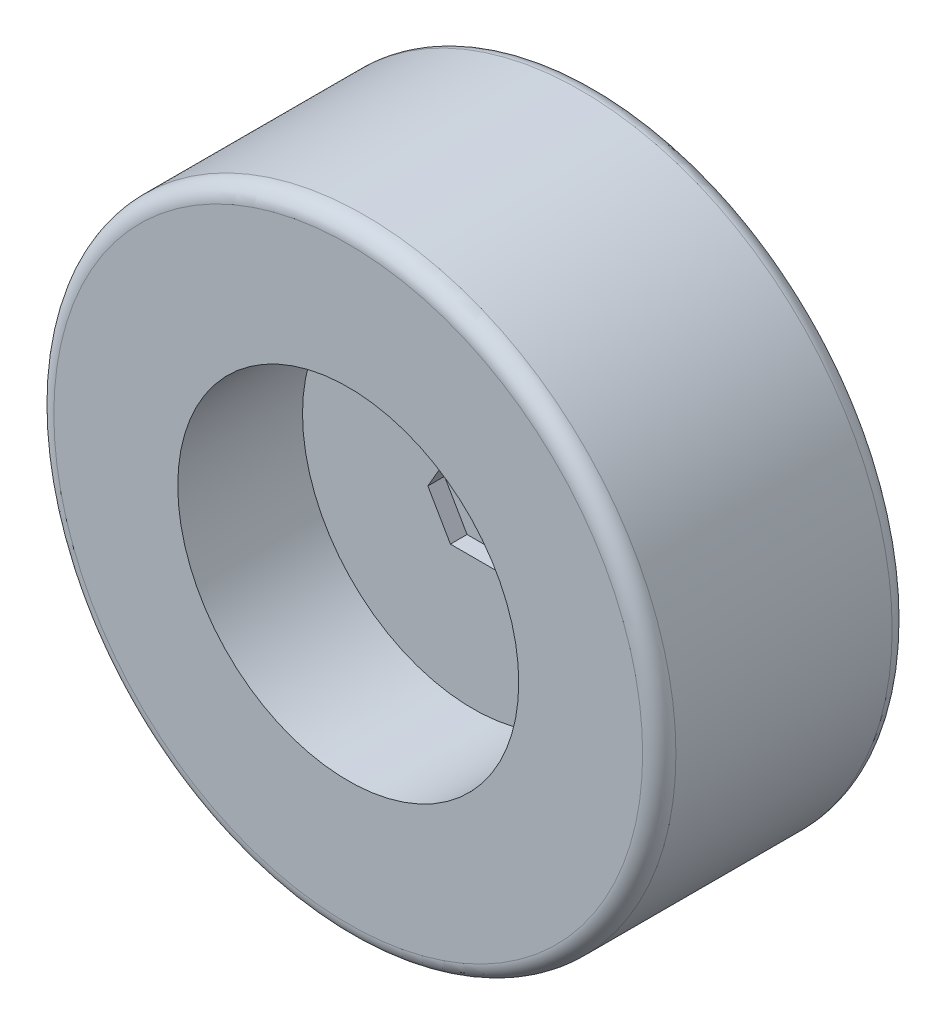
ISO-10303-21;
HEADER;
FILE_DESCRIPTION(('STEP AP214'),'2;1');
FILE_NAME('part.step','',(''),(''),'','','');
FILE_SCHEMA(('AUTOMOTIVE_DESIGN { 1 0 10303 214 1 1 1 1 }'));
ENDSEC;
DATA;
#1=APPLICATION_CONTEXT('core data for automotive mechanical design processes');
#2=APPLICATION_PROTOCOL_DEFINITION('international standard','automotive_design',2000,#1);
#3=PRODUCT_CONTEXT('',#1,'mechanical');
#4=PRODUCT('Part','Part','',(#3));
#5=PRODUCT_RELATED_PRODUCT_CATEGORY('part','',(#4));
#6=PRODUCT_DEFINITION_FORMATION('','',#4);
#7=PRODUCT_DEFINITION_CONTEXT('part definition',#1,'design');
#8=PRODUCT_DEFINITION('design','',#6,#7);
#9=PRODUCT_DEFINITION_SHAPE('','',#8);
#10=(LENGTH_UNIT() NAMED_UNIT(*) SI_UNIT(.MILLI.,.METRE.));
#11=(NAMED_UNIT(*) PLANE_ANGLE_UNIT() SI_UNIT($,.RADIAN.));
#12=(NAMED_UNIT(*) SI_UNIT($,.STERADIAN.) SOLID_ANGLE_UNIT());
#13=UNCERTAINTY_MEASURE_WITH_UNIT(LENGTH_MEASURE(1.E-05),#10,'distance_accuracy_value','');
#14=(GEOMETRIC_REPRESENTATION_CONTEXT(3) GLOBAL_UNCERTAINTY_ASSIGNED_CONTEXT((#13)) GLOBAL_UNIT_ASSIGNED_CONTEXT((#10,
#11,#12)) REPRESENTATION_CONTEXT('',''));
#15=CARTESIAN_POINT('',(0.,0.,0.));
#16=DIRECTION('',(0.,0.,1.));
#17=DIRECTION('',(1.,0.,0.));
#18=AXIS2_PLACEMENT_3D('',#15,#16,#17);
#19=CARTESIAN_POINT('',(0.,0.,38.1));
#20=DIRECTION('',(0.,0.,-1.));
#21=DIRECTION('',(-1.,0.,0.));
#22=AXIS2_PLACEMENT_3D('',#19,#20,#21);
#23=CYLINDRICAL_SURFACE('',#22,47.498);
#24=CARTESIAN_POINT('',(0.,0.,2.54));
#25=DIRECTION('',(0.,0.,1.));
#26=DIRECTION('',(1.,0.,0.));
#27=AXIS2_PLACEMENT_3D('',#24,#25,#26);
#28=CIRCLE('',#27,47.498);
#29=CARTESIAN_POINT('',(-47.498,0.,2.54));
#30=VERTEX_POINT('',#29);
#31=EDGE_CURVE('E157',#30,#30,#28,.T.);
#32=CARTESIAN_POINT('',(0.,0.,35.56));
#33=DIRECTION('',(0.,0.,1.));
#34=DIRECTION('',(1.,0.,0.));
#35=AXIS2_PLACEMENT_3D('',#32,#33,#34);
#36=CIRCLE('',#35,47.498);
#37=CARTESIAN_POINT('',(-47.498,0.,35.56));
#38=VERTEX_POINT('',#37);
#39=EDGE_CURVE('E149',#38,#38,#36,.F.);
#40=CARTESIAN_POINT('',(-47.498,0.,2.54));
#41=CARTESIAN_POINT('',(-47.498,0.,2.88395833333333));
#42=CARTESIAN_POINT('',(-47.498,0.,3.22791666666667));
#43=CARTESIAN_POINT('',(-47.498,0.,3.91583333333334));
#44=CARTESIAN_POINT('',(-47.498,0.,4.25979166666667));
#45=CARTESIAN_POINT('',(-47.498,0.,4.94770833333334));
#46=CARTESIAN_POINT('',(-47.498,0.,5.29166666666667));
#47=CARTESIAN_POINT('',(-47.498,0.,5.97958333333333));
#48=CARTESIAN_POINT('',(-47.498,0.,6.32354166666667));
#49=CARTESIAN_POINT('',(-47.498,0.,7.01145833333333));
#50=CARTESIAN_POINT('',(-47.498,0.,7.35541666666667));
#51=CARTESIAN_POINT('',(-47.498,0.,8.04333333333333));
#52=CARTESIAN_POINT('',(-47.498,0.,8.38729166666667));
#53=CARTESIAN_POINT('',(-47.498,0.,9.07520833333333));
#54=CARTESIAN_POINT('',(-47.498,0.,9.41916666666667));
#55=CARTESIAN_POINT('',(-47.498,0.,10.1070833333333));
#56=CARTESIAN_POINT('',(-47.498,0.,10.4510416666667));
#57=CARTESIAN_POINT('',(-47.498,0.,11.1389583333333));
#58=CARTESIAN_POINT('',(-47.498,0.,11.4829166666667));
#59=CARTESIAN_POINT('',(-47.498,0.,12.1708333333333));
#60=CARTESIAN_POINT('',(-47.498,0.,12.5147916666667));
#61=CARTESIAN_POINT('',(-47.498,0.,13.2027083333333));
#62=CARTESIAN_POINT('',(-47.498,0.,13.5466666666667));
#63=CARTESIAN_POINT('',(-47.498,0.,14.2345833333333));
#64=CARTESIAN_POINT('',(-47.498,0.,14.5785416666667));
#65=CARTESIAN_POINT('',(-47.498,0.,15.2664583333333));
#66=CARTESIAN_POINT('',(-47.498,0.,15.6104166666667));
#67=CARTESIAN_POINT('',(-47.498,0.,16.2983333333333));
#68=CARTESIAN_POINT('',(-47.498,0.,16.6422916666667));
#69=CARTESIAN_POINT('',(-47.498,0.,17.3302083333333));
#70=CARTESIAN_POINT('',(-47.498,0.,17.6741666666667));
#71=CARTESIAN_POINT('',(-47.498,0.,18.3620833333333));
#72=CARTESIAN_POINT('',(-47.498,0.,18.7060416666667));
#73=CARTESIAN_POINT('',(-47.498,0.,19.3939583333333));
#74=CARTESIAN_POINT('',(-47.498,0.,19.7379166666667));
#75=CARTESIAN_POINT('',(-47.498,0.,20.4258333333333));
#76=CARTESIAN_POINT('',(-47.498,0.,20.7697916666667));
#77=CARTESIAN_POINT('',(-47.498,0.,21.4577083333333));
#78=CARTESIAN_POINT('',(-47.498,0.,21.8016666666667));
#79=CARTESIAN_POINT('',(-47.498,0.,22.4895833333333));
#80=CARTESIAN_POINT('',(-47.498,0.,22.8335416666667));
#81=CARTESIAN_POINT('',(-47.498,0.,23.5214583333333));
#82=CARTESIAN_POINT('',(-47.498,0.,23.8654166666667));
#83=CARTESIAN_POINT('',(-47.498,0.,24.5533333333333));
#84=CARTESIAN_POINT('',(-47.498,0.,24.8972916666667));
#85=CARTESIAN_POINT('',(-47.498,0.,25.5852083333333));
#86=CARTESIAN_POINT('',(-47.498,0.,25.9291666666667));
#87=CARTESIAN_POINT('',(-47.498,0.,26.6170833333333));
#88=CARTESIAN_POINT('',(-47.498,0.,26.9610416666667));
#89=CARTESIAN_POINT('',(-47.498,0.,27.6489583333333));
#90=CARTESIAN_POINT('',(-47.498,0.,27.9929166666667));
#91=CARTESIAN_POINT('',(-47.498,0.,28.6808333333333));
#92=CARTESIAN_POINT('',(-47.498,0.,29.0247916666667));
#93=CARTESIAN_POINT('',(-47.498,0.,29.7127083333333));
#94=CARTESIAN_POINT('',(-47.498,0.,30.0566666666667));
#95=CARTESIAN_POINT('',(-47.498,0.,30.7445833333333));
#96=CARTESIAN_POINT('',(-47.498,0.,31.0885416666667));
#97=CARTESIAN_POINT('',(-47.498,0.,31.7764583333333));
#98=CARTESIAN_POINT('',(-47.498,0.,32.1204166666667));
#99=CARTESIAN_POINT('',(-47.498,0.,32.8083333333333));
#100=CARTESIAN_POINT('',(-47.498,0.,33.1522916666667));
#101=CARTESIAN_POINT('',(-47.498,0.,33.8402083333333));
#102=CARTESIAN_POINT('',(-47.498,0.,34.1841666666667));
#103=CARTESIAN_POINT('',(-47.498,0.,34.8720833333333));
#104=CARTESIAN_POINT('',(-47.498,0.,35.2160416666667));
#105=CARTESIAN_POINT('',(-47.498,0.,35.56));
#106=B_SPLINE_CURVE_WITH_KNOTS('',3,(#40,#41,#42,#43,#44,#45,#46,#47,#48,#49,#50,#51,#52,#53,
#54,#55,#56,#57,#58,#59,#60,#61,#62,#63,#64,#65,#66,#67,#68,#69,#70,#71,#72,#73,#74,#75,#76,#77,
#78,#79,#80,#81,#82,#83,#84,#85,#86,#87,#88,#89,#90,#91,#92,#93,#94,#95,#96,#97,#98,#99,#100,
#101,#102,#103,#104,#105),.UNSPECIFIED.,.F.,.F.,(4,2,2,2,2,2,2,2,2,2,2,2,2,2,2,2,2,2,2,2,2,2,2,
2,2,2,2,2,2,2,2,2,4),(0.,1.031875,2.06375,3.095625,4.1275,5.159375,6.19125,7.223125,8.255,
9.286875,10.31875,11.350625,12.3825,13.414375,14.44625,15.478125,16.51,17.541875,18.57375,
19.605625,20.6375,21.669375,22.70125,23.733125,24.765,25.796875,26.82875,27.860625,28.8925,
29.924375,30.95625,31.988125,33.02),.UNSPECIFIED.);
#107=EDGE_CURVE('BSEAM32',#30,#38,#106,.T.);
#108=ORIENTED_EDGE('',*,*,#31,.T.);
#109=ORIENTED_EDGE('',*,*,#39,.T.);
#110=ORIENTED_EDGE('',*,*,#107,.T.);
#111=ORIENTED_EDGE('',*,*,#107,.F.);
#112=EDGE_LOOP('',(#108,#110,#109,#111));
#113=FACE_BOUND('',#112,.T.);
#114=ADVANCED_FACE('F32',(#113),#23,.T.);
#115=CARTESIAN_POINT('',(0.,0.,38.1));
#116=DIRECTION('',(0.,0.,1.));
#117=DIRECTION('',(1.,0.,0.));
#118=AXIS2_PLACEMENT_3D('',#115,#116,#117);
#119=PLANE('',#118);
#120=CARTESIAN_POINT('',(0.,0.,38.1));
#121=DIRECTION('',(0.,0.,1.));
#122=DIRECTION('',(1.,0.,0.));
#123=AXIS2_PLACEMENT_3D('',#120,#121,#122);
#124=CIRCLE('',#123,44.958);
#125=CARTESIAN_POINT('',(44.958,0.,38.1));
#126=VERTEX_POINT('',#125);
#127=EDGE_CURVE('E11',#126,#126,#124,.T.);
#128=ORIENTED_EDGE('',*,*,#127,.T.);
#129=EDGE_LOOP('',(#128));
#130=FACE_BOUND('',#129,.T.);
#131=CARTESIAN_POINT('',(0.,0.,38.1));
#132=DIRECTION('',(0.,0.,1.));
#133=DIRECTION('',(1.,0.,0.));
#134=AXIS2_PLACEMENT_3D('',#131,#132,#133);
#135=CIRCLE('',#134,26.035);
#136=CARTESIAN_POINT('',(26.035,0.,38.1));
#137=VERTEX_POINT('',#136);
#138=EDGE_CURVE('E143',#137,#137,#135,.T.);
#139=ORIENTED_EDGE('',*,*,#138,.F.);
#140=EDGE_LOOP('',(#139));
#141=FACE_BOUND('',#140,.T.);
#142=ADVANCED_FACE('F173',(#130,#141),#119,.T.);
#143=CARTESIAN_POINT('',(0.,0.,0.));
#144=DIRECTION('',(0.,0.,1.));
#145=DIRECTION('',(1.,0.,0.));
#146=AXIS2_PLACEMENT_3D('',#143,#144,#145);
#147=PLANE('',#146);
#148=CARTESIAN_POINT('',(0.,0.,0.));
#149=DIRECTION('',(0.,0.,1.));
#150=DIRECTION('',(1.,0.,0.));
#151=AXIS2_PLACEMENT_3D('',#148,#149,#150);
#152=CIRCLE('',#151,44.958);
#153=CARTESIAN_POINT('',(44.958,0.,0.));
#154=VERTEX_POINT('',#153);
#155=EDGE_CURVE('E40',#154,#154,#152,.F.);
#156=ORIENTED_EDGE('',*,*,#155,.T.);
#157=EDGE_LOOP('',(#156));
#158=FACE_BOUND('',#157,.T.);
#159=CARTESIAN_POINT('',(0.,0.,0.));
#160=DIRECTION('',(0.,0.,-1.));
#161=DIRECTION('',(-1.,0.,0.));
#162=AXIS2_PLACEMENT_3D('',#159,#160,#161);
#163=CIRCLE('',#162,26.035);
#164=CARTESIAN_POINT('',(-26.035,0.,0.));
#165=VERTEX_POINT('',#164);
#166=EDGE_CURVE('E134',#165,#165,#163,.T.);
#167=ORIENTED_EDGE('',*,*,#166,.F.);
#168=EDGE_LOOP('',(#167));
#169=FACE_BOUND('',#168,.T.);
#170=ADVANCED_FACE('F162',(#158,#169),#147,.F.);
#171=CARTESIAN_POINT('',(0.,0.,19.05));
#172=DIRECTION('',(0.,0.,1.));
#173=DIRECTION('',(1.,0.,0.));
#174=AXIS2_PLACEMENT_3D('',#171,#172,#173);
#175=CYLINDRICAL_SURFACE('',#174,26.035);
#176=CARTESIAN_POINT('',(0.,0.,19.05));
#177=DIRECTION('',(0.,0.,1.));
#178=DIRECTION('',(1.,0.,0.));
#179=AXIS2_PLACEMENT_3D('',#176,#177,#178);
#180=CIRCLE('',#179,26.035);
#181=CARTESIAN_POINT('',(26.035,0.,19.05));
#182=VERTEX_POINT('',#181);
#183=EDGE_CURVE('E146',#182,#182,#180,.T.);
#184=CARTESIAN_POINT('',(26.035,0.,19.05));
#185=CARTESIAN_POINT('',(26.035,0.,19.2484375));
#186=CARTESIAN_POINT('',(26.035,0.,19.446875));
#187=CARTESIAN_POINT('',(26.035,0.,19.84375));
#188=CARTESIAN_POINT('',(26.035,0.,20.0421875));
#189=CARTESIAN_POINT('',(26.035,0.,20.4390625));
#190=CARTESIAN_POINT('',(26.035,0.,20.6375));
#191=CARTESIAN_POINT('',(26.035,0.,21.034375));
#192=CARTESIAN_POINT('',(26.035,0.,21.2328125));
#193=CARTESIAN_POINT('',(26.035,0.,21.6296875));
#194=CARTESIAN_POINT('',(26.035,0.,21.828125));
#195=CARTESIAN_POINT('',(26.035,0.,22.225));
#196=CARTESIAN_POINT('',(26.035,0.,22.4234375));
#197=CARTESIAN_POINT('',(26.035,0.,22.8203125));
#198=CARTESIAN_POINT('',(26.035,0.,23.01875));
#199=CARTESIAN_POINT('',(26.035,0.,23.415625));
#200=CARTESIAN_POINT('',(26.035,0.,23.6140625));
#201=CARTESIAN_POINT('',(26.035,0.,24.0109375));
#202=CARTESIAN_POINT('',(26.035,0.,24.209375));
#203=CARTESIAN_POINT('',(26.035,0.,24.60625));
#204=CARTESIAN_POINT('',(26.035,0.,24.8046875));
#205=CARTESIAN_POINT('',(26.035,0.,25.2015625));
#206=CARTESIAN_POINT('',(26.035,0.,25.4));
#207=CARTESIAN_POINT('',(26.035,0.,25.796875));
#208=CARTESIAN_POINT('',(26.035,0.,25.9953125));
#209=CARTESIAN_POINT('',(26.035,0.,26.3921875));
#210=CARTESIAN_POINT('',(26.035,0.,26.590625));
#211=CARTESIAN_POINT('',(26.035,0.,26.9875));
#212=CARTESIAN_POINT('',(26.035,0.,27.1859375));
#213=CARTESIAN_POINT('',(26.035,0.,27.5828125));
#214=CARTESIAN_POINT('',(26.035,0.,27.78125));
#215=CARTESIAN_POINT('',(26.035,0.,28.178125));
#216=CARTESIAN_POINT('',(26.035,0.,28.3765625));
#217=CARTESIAN_POINT('',(26.035,0.,28.7734375));
#218=CARTESIAN_POINT('',(26.035,0.,28.971875));
#219=CARTESIAN_POINT('',(26.035,0.,29.36875));
#220=CARTESIAN_POINT('',(26.035,0.,29.5671875));
#221=CARTESIAN_POINT('',(26.035,0.,29.9640625));
#222=CARTESIAN_POINT('',(26.035,0.,30.1625));
#223=CARTESIAN_POINT('',(26.035,0.,30.559375));
#224=CARTESIAN_POINT('',(26.035,0.,30.7578125));
#225=CARTESIAN_POINT('',(26.035,0.,31.1546875));
#226=CARTESIAN_POINT('',(26.035,0.,31.353125));
#227=CARTESIAN_POINT('',(26.035,0.,31.75));
#228=CARTESIAN_POINT('',(26.035,0.,31.9484375));
#229=CARTESIAN_POINT('',(26.035,0.,32.3453125));
#230=CARTESIAN_POINT('',(26.035,0.,32.54375));
#231=CARTESIAN_POINT('',(26.035,0.,32.940625));
#232=CARTESIAN_POINT('',(26.035,0.,33.1390625));
#233=CARTESIAN_POINT('',(26.035,0.,33.5359375));
#234=CARTESIAN_POINT('',(26.035,0.,33.734375));
#235=CARTESIAN_POINT('',(26.035,0.,34.13125));
#236=CARTESIAN_POINT('',(26.035,0.,34.3296875));
#237=CARTESIAN_POINT('',(26.035,0.,34.7265625));
#238=CARTESIAN_POINT('',(26.035,0.,34.925));
#239=CARTESIAN_POINT('',(26.035,0.,35.321875));
#240=CARTESIAN_POINT('',(26.035,0.,35.5203125));
#241=CARTESIAN_POINT('',(26.035,0.,35.9171875));
#242=CARTESIAN_POINT('',(26.035,0.,36.115625));
#243=CARTESIAN_POINT('',(26.035,0.,36.5125));
#244=CARTESIAN_POINT('',(26.035,0.,36.7109375));
#245=CARTESIAN_POINT('',(26.035,0.,37.1078125));
#246=CARTESIAN_POINT('',(26.035,0.,37.30625));
#247=CARTESIAN_POINT('',(26.035,0.,37.703125));
#248=CARTESIAN_POINT('',(26.035,0.,37.9015625));
#249=CARTESIAN_POINT('',(26.035,0.,38.1));
#250=B_SPLINE_CURVE_WITH_KNOTS('',3,(#184,#185,#186,#187,#188,#189,#190,#191,#192,#193,#194,
#195,#196,#197,#198,#199,#200,#201,#202,#203,#204,#205,#206,#207,#208,#209,#210,#211,#212,#213,
#214,#215,#216,#217,#218,#219,#220,#221,#222,#223,#224,#225,#226,#227,#228,#229,#230,#231,#232,
#233,#234,#235,#236,#237,#238,#239,#240,#241,#242,#243,#244,#245,#246,#247,#248,#249),
.UNSPECIFIED.,.F.,.F.,(4,2,2,2,2,2,2,2,2,2,2,2,2,2,2,2,2,2,2,2,2,2,2,2,2,2,2,2,2,2,2,2,4),(0.,
0.595312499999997,1.190625,1.7859375,2.38125,2.9765625,3.571875,4.1671875,4.7625,5.3578125,
5.953125,6.5484375,7.14375,7.7390625,8.334375,8.9296875,9.525,10.1203125,10.715625,11.3109375,
11.90625,12.5015625,13.096875,13.6921875,14.2875,14.8828125,15.478125,16.0734375,16.66875,
17.2640625,17.859375,18.4546875,19.05),.UNSPECIFIED.);
#251=EDGE_CURVE('BSEAM186',#182,#137,#250,.T.);
#252=ORIENTED_EDGE('',*,*,#183,.F.);
#253=ORIENTED_EDGE('',*,*,#138,.T.);
#254=ORIENTED_EDGE('',*,*,#251,.T.);
#255=ORIENTED_EDGE('',*,*,#251,.F.);
#256=EDGE_LOOP('',(#252,#254,#253,#255));
#257=FACE_BOUND('',#256,.T.);
#258=ADVANCED_FACE('F186',(#257),#175,.F.);
#259=CARTESIAN_POINT('',(0.,0.,19.05));
#260=DIRECTION('',(0.,0.,1.));
#261=DIRECTION('',(1.,0.,0.));
#262=AXIS2_PLACEMENT_3D('',#259,#260,#261);
#263=PLANE('',#262);
#264=DIRECTION('',(0.5,0.866025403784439,0.));
#265=VECTOR('',#264,1.);
#266=CARTESIAN_POINT('',(3.44620375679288,-5.969,19.05));
#267=LINE('',#266,#265);
#268=CARTESIAN_POINT('',(3.44620375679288,-5.969,19.05));
#269=VERTEX_POINT('',#268);
#270=CARTESIAN_POINT('',(6.89240751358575,0.,19.05));
#271=VERTEX_POINT('',#270);
#272=EDGE_CURVE('E119',#269,#271,#267,.T.);
#273=ORIENTED_EDGE('',*,*,#272,.F.);
#274=DIRECTION('',(1.,0.,0.));
#275=VECTOR('',#274,1.);
#276=CARTESIAN_POINT('',(-3.44620375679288,-5.969,19.05));
#277=LINE('',#276,#275);
#278=CARTESIAN_POINT('',(-3.44620375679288,-5.969,19.05));
#279=VERTEX_POINT('',#278);
#280=EDGE_CURVE('E130',#279,#269,#277,.T.);
#281=ORIENTED_EDGE('',*,*,#280,.F.);
#282=DIRECTION('',(0.5,-0.866025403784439,0.));
#283=VECTOR('',#282,1.);
#284=CARTESIAN_POINT('',(-6.89240751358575,0.,19.05));
#285=LINE('',#284,#283);
#286=CARTESIAN_POINT('',(-6.89240751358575,0.,19.05));
#287=VERTEX_POINT('',#286);
#288=EDGE_CURVE('E47',#287,#279,#285,.T.);
#289=ORIENTED_EDGE('',*,*,#288,.F.);
#290=DIRECTION('',(-0.5,-0.866025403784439,0.));
#291=VECTOR('',#290,1.);
#292=CARTESIAN_POINT('',(-3.44620375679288,5.969,19.05));
#293=LINE('',#292,#291);
#294=CARTESIAN_POINT('',(-3.44620375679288,5.969,19.05));
#295=VERTEX_POINT('',#294);
#296=EDGE_CURVE('E97',#295,#287,#293,.T.);
#297=ORIENTED_EDGE('',*,*,#296,.F.);
#298=DIRECTION('',(-1.,0.,0.));
#299=VECTOR('',#298,1.);
#300=CARTESIAN_POINT('',(3.44620375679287,5.969,19.05));
#301=LINE('',#300,#299);
#302=CARTESIAN_POINT('',(3.44620375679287,5.969,19.05));
#303=VERTEX_POINT('',#302);
#304=EDGE_CURVE('E125',#303,#295,#301,.T.);
#305=ORIENTED_EDGE('',*,*,#304,.F.);
#306=DIRECTION('',(-0.5,0.866025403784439,0.));
#307=VECTOR('',#306,1.);
#308=CARTESIAN_POINT('',(6.89240751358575,0.,19.05));
#309=LINE('',#308,#307);
#310=EDGE_CURVE('E121',#271,#303,#309,.T.);
#311=ORIENTED_EDGE('',*,*,#310,.F.);
#312=EDGE_LOOP('',(#273,#281,#289,#297,#305,#311));
#313=FACE_BOUND('',#312,.T.);
#314=ORIENTED_EDGE('',*,*,#183,.T.);
#315=EDGE_LOOP('',(#314));
#316=FACE_BOUND('',#315,.T.);
#317=ADVANCED_FACE('F188',(#313,#316),#263,.T.);
#318=CARTESIAN_POINT('',(0.,0.,6.35));
#319=DIRECTION('',(0.,0.,-1.));
#320=DIRECTION('',(-1.,0.,0.));
#321=AXIS2_PLACEMENT_3D('',#318,#319,#320);
#322=CYLINDRICAL_SURFACE('',#321,26.035);
#323=CARTESIAN_POINT('',(0.,0.,6.35));
#324=DIRECTION('',(0.,0.,-1.));
#325=DIRECTION('',(-1.,0.,0.));
#326=AXIS2_PLACEMENT_3D('',#323,#324,#325);
#327=CIRCLE('',#326,26.035);
#328=CARTESIAN_POINT('',(-26.035,0.,6.35));
#329=VERTEX_POINT('',#328);
#330=EDGE_CURVE('E140',#329,#329,#327,.T.);
#331=ORIENTED_EDGE('',*,*,#330,.F.);
#332=EDGE_LOOP('',(#331));
#333=FACE_BOUND('',#332,.T.);
#334=ORIENTED_EDGE('',*,*,#166,.T.);
#335=EDGE_LOOP('',(#334));
#336=FACE_BOUND('',#335,.T.);
#337=ADVANCED_FACE('F195',(#333,#336),#322,.F.);
#338=CARTESIAN_POINT('',(0.,0.,6.35));
#339=DIRECTION('',(0.,0.,-1.));
#340=DIRECTION('',(-1.,0.,0.));
#341=AXIS2_PLACEMENT_3D('',#338,#339,#340);
#342=PLANE('',#341);
#343=CARTESIAN_POINT('',(0.,0.,6.35));
#344=DIRECTION('',(0.,0.,-1.));
#345=DIRECTION('',(-1.,0.,0.));
#346=AXIS2_PLACEMENT_3D('',#343,#344,#345);
#347=CIRCLE('',#346,1.5875);
#348=CARTESIAN_POINT('',(-1.5875,0.,6.35));
#349=VERTEX_POINT('',#348);
#350=EDGE_CURVE('E154',#349,#349,#347,.T.);
#351=ORIENTED_EDGE('',*,*,#350,.F.);
#352=EDGE_LOOP('',(#351));
#353=FACE_BOUND('',#352,.T.);
#354=ORIENTED_EDGE('',*,*,#330,.T.);
#355=EDGE_LOOP('',(#354));
#356=FACE_BOUND('',#355,.T.);
#357=ADVANCED_FACE('F203',(#353,#356),#342,.T.);
#358=CARTESIAN_POINT('',(3.44620375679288,-5.969,16.51));
#359=DIRECTION('',(0.866025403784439,-0.5,0.));
#360=DIRECTION('',(0.5,0.866025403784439,0.));
#361=AXIS2_PLACEMENT_3D('',#358,#359,#360);
#362=PLANE('',#361);
#363=ORIENTED_EDGE('',*,*,#272,.T.);
#364=DIRECTION('',(0.,0.,1.));
#365=VECTOR('',#364,1.);
#366=CARTESIAN_POINT('',(6.89240751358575,0.,16.51));
#367=LINE('',#366,#365);
#368=CARTESIAN_POINT('',(6.89240751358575,0.,16.51));
#369=VERTEX_POINT('',#368);
#370=EDGE_CURVE('E79',#369,#271,#367,.T.);
#371=ORIENTED_EDGE('',*,*,#370,.F.);
#372=DIRECTION('',(0.5,0.866025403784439,0.));
#373=VECTOR('',#372,1.);
#374=CARTESIAN_POINT('',(3.44620375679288,-5.969,16.51));
#375=LINE('',#374,#373);
#376=CARTESIAN_POINT('',(3.44620375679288,-5.969,16.51));
#377=VERTEX_POINT('',#376);
#378=EDGE_CURVE('E132',#377,#369,#375,.T.);
#379=ORIENTED_EDGE('',*,*,#378,.F.);
#380=DIRECTION('',(0.,0.,1.));
#381=VECTOR('',#380,1.);
#382=CARTESIAN_POINT('',(3.44620375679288,-5.969,16.51));
#383=LINE('',#382,#381);
#384=EDGE_CURVE('E56',#377,#269,#383,.T.);
#385=ORIENTED_EDGE('',*,*,#384,.T.);
#386=EDGE_LOOP('',(#363,#371,#379,#385));
#387=FACE_BOUND('',#386,.T.);
#388=ADVANCED_FACE('F207',(#387),#362,.F.);
#389=CARTESIAN_POINT('',(-3.44620375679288,-5.969,16.51));
#390=DIRECTION('',(0.,-1.,0.));
#391=DIRECTION('',(1.,0.,0.));
#392=AXIS2_PLACEMENT_3D('',#389,#390,#391);
#393=PLANE('',#392);
#394=ORIENTED_EDGE('',*,*,#280,.T.);
#395=ORIENTED_EDGE('',*,*,#384,.F.);
#396=DIRECTION('',(1.,0.,0.));
#397=VECTOR('',#396,1.);
#398=CARTESIAN_POINT('',(-3.44620375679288,-5.969,16.51));
#399=LINE('',#398,#397);
#400=CARTESIAN_POINT('',(-3.44620375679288,-5.969,16.51));
#401=VERTEX_POINT('',#400);
#402=EDGE_CURVE('E106',#401,#377,#399,.T.);
#403=ORIENTED_EDGE('',*,*,#402,.F.);
#404=DIRECTION('',(0.,0.,1.));
#405=VECTOR('',#404,1.);
#406=CARTESIAN_POINT('',(-3.44620375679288,-5.969,16.51));
#407=LINE('',#406,#405);
#408=EDGE_CURVE('E98',#401,#279,#407,.T.);
#409=ORIENTED_EDGE('',*,*,#408,.T.);
#410=EDGE_LOOP('',(#394,#395,#403,#409));
#411=FACE_BOUND('',#410,.T.);
#412=ADVANCED_FACE('F211',(#411),#393,.F.);
#413=CARTESIAN_POINT('',(-6.89240751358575,0.,16.51));
#414=DIRECTION('',(-0.866025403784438,-0.5,0.));
#415=DIRECTION('',(0.5,-0.866025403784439,0.));
#416=AXIS2_PLACEMENT_3D('',#413,#414,#415);
#417=PLANE('',#416);
#418=ORIENTED_EDGE('',*,*,#288,.T.);
#419=ORIENTED_EDGE('',*,*,#408,.F.);
#420=DIRECTION('',(0.5,-0.866025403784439,0.));
#421=VECTOR('',#420,1.);
#422=CARTESIAN_POINT('',(-6.89240751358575,0.,16.51));
#423=LINE('',#422,#421);
#424=CARTESIAN_POINT('',(-6.89240751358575,0.,16.51));
#425=VERTEX_POINT('',#424);
#426=EDGE_CURVE('E102',#425,#401,#423,.T.);
#427=ORIENTED_EDGE('',*,*,#426,.F.);
#428=DIRECTION('',(0.,0.,1.));
#429=VECTOR('',#428,1.);
#430=CARTESIAN_POINT('',(-6.89240751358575,0.,16.51));
#431=LINE('',#430,#429);
#432=EDGE_CURVE('E90',#425,#287,#431,.T.);
#433=ORIENTED_EDGE('',*,*,#432,.T.);
#434=EDGE_LOOP('',(#418,#419,#427,#433));
#435=FACE_BOUND('',#434,.T.);
#436=ADVANCED_FACE('F103',(#435),#417,.F.);
#437=CARTESIAN_POINT('',(-3.44620375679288,5.969,16.51));
#438=DIRECTION('',(-0.866025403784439,0.5,0.));
#439=DIRECTION('',(-0.5,-0.866025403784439,0.));
#440=AXIS2_PLACEMENT_3D('',#437,#438,#439);
#441=PLANE('',#440);
#442=ORIENTED_EDGE('',*,*,#296,.T.);
#443=ORIENTED_EDGE('',*,*,#432,.F.);
#444=DIRECTION('',(-0.5,-0.866025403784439,0.));
#445=VECTOR('',#444,1.);
#446=CARTESIAN_POINT('',(-3.44620375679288,5.969,16.51));
#447=LINE('',#446,#445);
#448=CARTESIAN_POINT('',(-3.44620375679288,5.969,16.51));
#449=VERTEX_POINT('',#448);
#450=EDGE_CURVE('E94',#449,#425,#447,.T.);
#451=ORIENTED_EDGE('',*,*,#450,.F.);
#452=DIRECTION('',(0.,0.,1.));
#453=VECTOR('',#452,1.);
#454=CARTESIAN_POINT('',(-3.44620375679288,5.969,16.51));
#455=LINE('',#454,#453);
#456=EDGE_CURVE('E99',#449,#295,#455,.T.);
#457=ORIENTED_EDGE('',*,*,#456,.T.);
#458=EDGE_LOOP('',(#442,#443,#451,#457));
#459=FACE_BOUND('',#458,.T.);
#460=ADVANCED_FACE('F92',(#459),#441,.F.);
#461=CARTESIAN_POINT('',(3.44620375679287,5.969,16.51));
#462=DIRECTION('',(0.,1.,0.));
#463=DIRECTION('',(0.,0.,1.));
#464=AXIS2_PLACEMENT_3D('',#461,#462,#463);
#465=PLANE('',#464);
#466=ORIENTED_EDGE('',*,*,#304,.T.);
#467=ORIENTED_EDGE('',*,*,#456,.F.);
#468=DIRECTION('',(-1.,0.,0.));
#469=VECTOR('',#468,1.);
#470=CARTESIAN_POINT('',(3.44620375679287,5.969,16.51));
#471=LINE('',#470,#469);
#472=CARTESIAN_POINT('',(3.44620375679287,5.969,16.51));
#473=VERTEX_POINT('',#472);
#474=EDGE_CURVE('E112',#473,#449,#471,.T.);
#475=ORIENTED_EDGE('',*,*,#474,.F.);
#476=DIRECTION('',(0.,0.,1.));
#477=VECTOR('',#476,1.);
#478=CARTESIAN_POINT('',(3.44620375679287,5.969,16.51));
#479=LINE('',#478,#477);
#480=EDGE_CURVE('E137',#473,#303,#479,.T.);
#481=ORIENTED_EDGE('',*,*,#480,.T.);
#482=EDGE_LOOP('',(#466,#467,#475,#481));
#483=FACE_BOUND('',#482,.T.);
#484=ADVANCED_FACE('F215',(#483),#465,.F.);
#485=CARTESIAN_POINT('',(6.89240751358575,0.,16.51));
#486=DIRECTION('',(0.866025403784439,0.5,0.));
#487=DIRECTION('',(-0.5,0.866025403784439,0.));
#488=AXIS2_PLACEMENT_3D('',#485,#486,#487);
#489=PLANE('',#488);
#490=ORIENTED_EDGE('',*,*,#310,.T.);
#491=ORIENTED_EDGE('',*,*,#480,.F.);
#492=DIRECTION('',(-0.5,0.866025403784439,0.));
#493=VECTOR('',#492,1.);
#494=CARTESIAN_POINT('',(6.89240751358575,0.,16.51));
#495=LINE('',#494,#493);
#496=EDGE_CURVE('E114',#369,#473,#495,.T.);
#497=ORIENTED_EDGE('',*,*,#496,.F.);
#498=ORIENTED_EDGE('',*,*,#370,.T.);
#499=EDGE_LOOP('',(#490,#491,#497,#498));
#500=FACE_BOUND('',#499,.T.);
#501=ADVANCED_FACE('F212',(#500),#489,.F.);
#502=CARTESIAN_POINT('',(0.,0.,16.51));
#503=DIRECTION('',(0.,0.,1.));
#504=DIRECTION('',(1.,0.,0.));
#505=AXIS2_PLACEMENT_3D('',#502,#503,#504);
#506=PLANE('',#505);
#507=CARTESIAN_POINT('',(0.,0.,16.51));
#508=DIRECTION('',(0.,0.,1.));
#509=DIRECTION('',(1.,0.,0.));
#510=AXIS2_PLACEMENT_3D('',#507,#508,#509);
#511=CIRCLE('',#510,1.5875);
#512=CARTESIAN_POINT('',(1.5875,0.,16.51));
#513=VERTEX_POINT('',#512);
#514=EDGE_CURVE('E122',#513,#513,#511,.T.);
#515=ORIENTED_EDGE('',*,*,#514,.F.);
#516=EDGE_LOOP('',(#515));
#517=FACE_BOUND('',#516,.T.);
#518=ORIENTED_EDGE('',*,*,#378,.T.);
#519=ORIENTED_EDGE('',*,*,#496,.T.);
#520=ORIENTED_EDGE('',*,*,#474,.T.);
#521=ORIENTED_EDGE('',*,*,#450,.T.);
#522=ORIENTED_EDGE('',*,*,#426,.T.);
#523=ORIENTED_EDGE('',*,*,#402,.T.);
#524=EDGE_LOOP('',(#518,#519,#520,#521,#522,#523));
#525=FACE_BOUND('',#524,.T.);
#526=ADVANCED_FACE('F109',(#517,#525),#506,.T.);
#527=CARTESIAN_POINT('',(0.,0.,38.1));
#528=DIRECTION('',(0.,0.,-1.));
#529=DIRECTION('',(-1.,0.,0.));
#530=AXIS2_PLACEMENT_3D('',#527,#528,#529);
#531=CYLINDRICAL_SURFACE('',#530,1.5875);
#532=ORIENTED_EDGE('',*,*,#514,.T.);
#533=EDGE_LOOP('',(#532));
#534=FACE_BOUND('',#533,.T.);
#535=ORIENTED_EDGE('',*,*,#350,.T.);
#536=EDGE_LOOP('',(#535));
#537=FACE_BOUND('',#536,.T.);
#538=ADVANCED_FACE('F168',(#534,#537),#531,.F.);
#539=CARTESIAN_POINT('',(0.,0.,2.54));
#540=DIRECTION('',(0.,0.,1.));
#541=DIRECTION('',(1.,0.,0.));
#542=AXIS2_PLACEMENT_3D('',#539,#540,#541);
#543=TOROIDAL_SURFACE('',#542,44.958,2.54);
#544=ORIENTED_EDGE('',*,*,#155,.F.);
#545=EDGE_LOOP('',(#544));
#546=FACE_BOUND('',#545,.T.);
#547=ORIENTED_EDGE('',*,*,#31,.F.);
#548=EDGE_LOOP('',(#547));
#549=FACE_BOUND('',#548,.T.);
#550=ADVANCED_FACE('F165',(#546,#549),#543,.T.);
#551=CARTESIAN_POINT('',(0.,0.,35.56));
#552=DIRECTION('',(0.,0.,1.));
#553=DIRECTION('',(1.,0.,0.));
#554=AXIS2_PLACEMENT_3D('',#551,#552,#553);
#555=TOROIDAL_SURFACE('',#554,44.958,2.54);
#556=ORIENTED_EDGE('',*,*,#39,.F.);
#557=EDGE_LOOP('',(#556));
#558=FACE_BOUND('',#557,.T.);
#559=ORIENTED_EDGE('',*,*,#127,.F.);
#560=EDGE_LOOP('',(#559));
#561=FACE_BOUND('',#560,.T.);
#562=ADVANCED_FACE('F34',(#558,#561),#555,.T.);
#563=CLOSED_SHELL('',(#114,#142,#170,#258,#317,#337,#357,#388,#412,#436,#460,#484,#501,#526,
#538,#550,#562));
#564=MANIFOLD_SOLID_BREP('B2',#563);
#565=ADVANCED_BREP_SHAPE_REPRESENTATION('',(#18,#564),#14);
#566=SHAPE_DEFINITION_REPRESENTATION(#9,#565);
ENDSEC;
END-ISO-10303-21;
